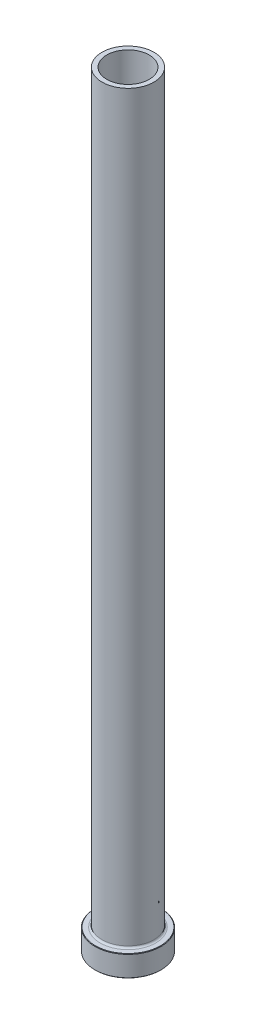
ISO-10303-21;
HEADER;
FILE_DESCRIPTION(('STEP AP214'),'2;1');
FILE_NAME('part.step','',(''),(''),'','','');
FILE_SCHEMA(('AUTOMOTIVE_DESIGN { 1 0 10303 214 1 1 1 1 }'));
ENDSEC;
DATA;
#1=APPLICATION_CONTEXT('core data for automotive mechanical design processes');
#2=APPLICATION_PROTOCOL_DEFINITION('international standard','automotive_design',2000,#1);
#3=PRODUCT_CONTEXT('',#1,'mechanical');
#4=PRODUCT('Part','Part','',(#3));
#5=PRODUCT_RELATED_PRODUCT_CATEGORY('part','',(#4));
#6=PRODUCT_DEFINITION_FORMATION('','',#4);
#7=PRODUCT_DEFINITION_CONTEXT('part definition',#1,'design');
#8=PRODUCT_DEFINITION('design','',#6,#7);
#9=PRODUCT_DEFINITION_SHAPE('','',#8);
#10=(LENGTH_UNIT() NAMED_UNIT(*) SI_UNIT(.MILLI.,.METRE.));
#11=(NAMED_UNIT(*) PLANE_ANGLE_UNIT() SI_UNIT($,.RADIAN.));
#12=(NAMED_UNIT(*) SI_UNIT($,.STERADIAN.) SOLID_ANGLE_UNIT());
#13=UNCERTAINTY_MEASURE_WITH_UNIT(LENGTH_MEASURE(1.E-05),#10,'distance_accuracy_value','');
#14=(GEOMETRIC_REPRESENTATION_CONTEXT(3) GLOBAL_UNCERTAINTY_ASSIGNED_CONTEXT((#13)) GLOBAL_UNIT_ASSIGNED_CONTEXT((#10,
#11,#12)) REPRESENTATION_CONTEXT('',''));
#15=CARTESIAN_POINT('',(0.,0.,0.));
#16=DIRECTION('',(0.,0.,1.));
#17=DIRECTION('',(1.,0.,0.));
#18=AXIS2_PLACEMENT_3D('',#15,#16,#17);
#19=CARTESIAN_POINT('',(0.,92.1876809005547,0.));
#20=DIRECTION('',(0.,1.,0.));
#21=DIRECTION('',(0.,0.,1.));
#22=AXIS2_PLACEMENT_3D('',#19,#20,#21);
#23=CYLINDRICAL_SURFACE('',#22,9.00000000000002);
#24=CARTESIAN_POINT('',(0.,325.,0.));
#25=DIRECTION('',(0.,1.,0.));
#26=DIRECTION('',(0.,0.,1.));
#27=AXIS2_PLACEMENT_3D('',#24,#25,#26);
#28=CIRCLE('',#27,9.00000000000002);
#29=CARTESIAN_POINT('',(0.,325.,9.00000000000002));
#30=VERTEX_POINT('',#29);
#31=EDGE_CURVE('E62',#30,#30,#28,.T.);
#32=ORIENTED_EDGE('',*,*,#31,.T.);
#33=EDGE_LOOP('',(#32));
#34=FACE_BOUND('',#33,.T.);
#35=CARTESIAN_POINT('',(0.,270.,0.));
#36=DIRECTION('',(0.,1.,0.));
#37=DIRECTION('',(0.,0.,1.));
#38=AXIS2_PLACEMENT_3D('',#35,#36,#37);
#39=CIRCLE('',#38,9.00000000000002);
#40=CARTESIAN_POINT('',(0.,270.,9.00000000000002));
#41=VERTEX_POINT('',#40);
#42=EDGE_CURVE('E71',#41,#41,#39,.T.);
#43=ORIENTED_EDGE('',*,*,#42,.F.);
#44=EDGE_LOOP('',(#43));
#45=FACE_BOUND('',#44,.T.);
#46=ADVANCED_FACE('F30',(#34,#45),#23,.F.);
#47=CARTESIAN_POINT('',(-9.00000000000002,325.,0.));
#48=DIRECTION('',(0.,1.,0.));
#49=DIRECTION('',(0.,0.,1.));
#50=AXIS2_PLACEMENT_3D('',#47,#48,#49);
#51=PLANE('',#50);
#52=CARTESIAN_POINT('',(0.,325.,0.));
#53=DIRECTION('',(0.,1.,0.));
#54=DIRECTION('',(0.,0.,1.));
#55=AXIS2_PLACEMENT_3D('',#52,#53,#54);
#56=CIRCLE('',#55,11.);
#57=CARTESIAN_POINT('',(0.,325.,11.));
#58=VERTEX_POINT('',#57);
#59=EDGE_CURVE('E65',#58,#58,#56,.T.);
#60=ORIENTED_EDGE('',*,*,#59,.T.);
#61=EDGE_LOOP('',(#60));
#62=FACE_BOUND('',#61,.T.);
#63=ORIENTED_EDGE('',*,*,#31,.F.);
#64=EDGE_LOOP('',(#63));
#65=FACE_BOUND('',#64,.T.);
#66=ADVANCED_FACE('F79',(#62,#65),#51,.T.);
#67=CARTESIAN_POINT('',(0.,92.1876809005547,0.));
#68=DIRECTION('',(0.,1.,0.));
#69=DIRECTION('',(0.,0.,1.));
#70=AXIS2_PLACEMENT_3D('',#67,#68,#69);
#71=CYLINDRICAL_SURFACE('',#70,11.);
#72=CARTESIAN_POINT('',(0.,9.8,0.));
#73=DIRECTION('',(0.,1.,0.));
#74=DIRECTION('',(0.,0.,1.));
#75=AXIS2_PLACEMENT_3D('',#72,#73,#74);
#76=CIRCLE('',#75,11.);
#77=CARTESIAN_POINT('',(0.,9.8,11.));
#78=VERTEX_POINT('',#77);
#79=EDGE_CURVE('E59',#78,#78,#76,.T.);
#80=ORIENTED_EDGE('',*,*,#79,.T.);
#81=EDGE_LOOP('',(#80));
#82=FACE_BOUND('',#81,.T.);
#83=ORIENTED_EDGE('',*,*,#59,.F.);
#84=EDGE_LOOP('',(#83));
#85=FACE_BOUND('',#84,.T.);
#86=ADVANCED_FACE('F85',(#82,#85),#71,.T.);
#87=CARTESIAN_POINT('',(-11.,9.,0.));
#88=DIRECTION('',(0.,1.,0.));
#89=DIRECTION('',(0.,0.,1.));
#90=AXIS2_PLACEMENT_3D('',#87,#88,#89);
#91=PLANE('',#90);
#92=CARTESIAN_POINT('',(0.,9.,0.));
#93=DIRECTION('',(0.,1.,0.));
#94=DIRECTION('',(0.,0.,1.));
#95=AXIS2_PLACEMENT_3D('',#92,#93,#94);
#96=CIRCLE('',#95,13.8);
#97=CARTESIAN_POINT('',(0.,9.,13.8));
#98=VERTEX_POINT('',#97);
#99=EDGE_CURVE('E53',#98,#98,#96,.T.);
#100=ORIENTED_EDGE('',*,*,#99,.T.);
#101=EDGE_LOOP('',(#100));
#102=FACE_BOUND('',#101,.T.);
#103=CARTESIAN_POINT('',(0.,9.,0.));
#104=DIRECTION('',(0.,1.,0.));
#105=DIRECTION('',(0.,0.,1.));
#106=AXIS2_PLACEMENT_3D('',#103,#104,#105);
#107=CIRCLE('',#106,11.8);
#108=CARTESIAN_POINT('',(0.,9.,11.8));
#109=VERTEX_POINT('',#108);
#110=EDGE_CURVE('E56',#109,#109,#107,.F.);
#111=ORIENTED_EDGE('',*,*,#110,.T.);
#112=EDGE_LOOP('',(#111));
#113=FACE_BOUND('',#112,.T.);
#114=ADVANCED_FACE('F111',(#102,#113),#91,.T.);
#115=CARTESIAN_POINT('',(0.,92.1876809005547,0.));
#116=DIRECTION('',(0.,1.,0.));
#117=DIRECTION('',(0.,0.,1.));
#118=AXIS2_PLACEMENT_3D('',#115,#116,#117);
#119=CYLINDRICAL_SURFACE('',#118,14.);
#120=CARTESIAN_POINT('',(0.,8.8,0.));
#121=DIRECTION('',(0.,1.,0.));
#122=DIRECTION('',(0.,0.,1.));
#123=AXIS2_PLACEMENT_3D('',#120,#121,#122);
#124=CIRCLE('',#123,14.);
#125=CARTESIAN_POINT('',(0.,8.8,14.));
#126=VERTEX_POINT('',#125);
#127=EDGE_CURVE('E45',#126,#126,#124,.F.);
#128=ORIENTED_EDGE('',*,*,#127,.T.);
#129=EDGE_LOOP('',(#128));
#130=FACE_BOUND('',#129,.T.);
#131=CARTESIAN_POINT('',(0.,0.20000000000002,0.));
#132=DIRECTION('',(0.,-1.,0.));
#133=DIRECTION('',(0.,0.,-1.));
#134=AXIS2_PLACEMENT_3D('',#131,#132,#133);
#135=CIRCLE('',#134,14.);
#136=CARTESIAN_POINT('',(0.,0.20000000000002,-14.));
#137=VERTEX_POINT('',#136);
#138=EDGE_CURVE('E50',#137,#137,#135,.F.);
#139=ORIENTED_EDGE('',*,*,#138,.T.);
#140=EDGE_LOOP('',(#139));
#141=FACE_BOUND('',#140,.T.);
#142=ADVANCED_FACE('F108',(#130,#141),#119,.T.);
#143=CARTESIAN_POINT('',(-14.,0.,0.));
#144=DIRECTION('',(0.,-1.,0.));
#145=DIRECTION('',(0.,0.,-1.));
#146=AXIS2_PLACEMENT_3D('',#143,#144,#145);
#147=PLANE('',#146);
#148=CARTESIAN_POINT('',(0.,0.,0.));
#149=DIRECTION('',(0.,-1.,0.));
#150=DIRECTION('',(0.,0.,-1.));
#151=AXIS2_PLACEMENT_3D('',#148,#149,#150);
#152=CIRCLE('',#151,9.75000000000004);
#153=CARTESIAN_POINT('',(0.,0.,-9.75000000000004));
#154=VERTEX_POINT('',#153);
#155=EDGE_CURVE('E37',#154,#154,#152,.F.);
#156=ORIENTED_EDGE('',*,*,#155,.T.);
#157=EDGE_LOOP('',(#156));
#158=FACE_BOUND('',#157,.T.);
#159=CARTESIAN_POINT('',(0.,0.,0.));
#160=DIRECTION('',(0.,-1.,0.));
#161=DIRECTION('',(0.,0.,-1.));
#162=AXIS2_PLACEMENT_3D('',#159,#160,#161);
#163=CIRCLE('',#162,13.7999999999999);
#164=CARTESIAN_POINT('',(0.,0.,-13.7999999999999));
#165=VERTEX_POINT('',#164);
#166=EDGE_CURVE('E41',#165,#165,#163,.T.);
#167=ORIENTED_EDGE('',*,*,#166,.T.);
#168=EDGE_LOOP('',(#167));
#169=FACE_BOUND('',#168,.T.);
#170=ADVANCED_FACE('F110',(#158,#169),#147,.T.);
#171=CARTESIAN_POINT('',(0.,92.1876809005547,0.));
#172=DIRECTION('',(0.,1.,0.));
#173=DIRECTION('',(0.,0.,1.));
#174=AXIS2_PLACEMENT_3D('',#171,#172,#173);
#175=CYLINDRICAL_SURFACE('',#174,9.25000000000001);
#176=CARTESIAN_POINT('',(0.,0.500000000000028,0.));
#177=DIRECTION('',(0.,-1.,0.));
#178=DIRECTION('',(0.,0.,-1.));
#179=AXIS2_PLACEMENT_3D('',#176,#177,#178);
#180=CIRCLE('',#179,9.25000000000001);
#181=CARTESIAN_POINT('',(0.,0.500000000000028,-9.25000000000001));
#182=VERTEX_POINT('',#181);
#183=EDGE_CURVE('E10',#182,#182,#180,.T.);
#184=ORIENTED_EDGE('',*,*,#183,.T.);
#185=EDGE_LOOP('',(#184));
#186=FACE_BOUND('',#185,.T.);
#187=CARTESIAN_POINT('',(0.,258.,0.));
#188=DIRECTION('',(0.,1.,0.));
#189=DIRECTION('',(0.,0.,1.));
#190=AXIS2_PLACEMENT_3D('',#187,#188,#189);
#191=CIRCLE('',#190,9.25000000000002);
#192=CARTESIAN_POINT('',(0.,258.,9.25000000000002));
#193=VERTEX_POINT('',#192);
#194=EDGE_CURVE('E68',#193,#193,#191,.T.);
#195=ORIENTED_EDGE('',*,*,#194,.T.);
#196=EDGE_LOOP('',(#195));
#197=FACE_BOUND('',#196,.T.);
#198=ADVANCED_FACE('F118',(#186,#197),#175,.F.);
#199=CARTESIAN_POINT('',(0.,258.,0.));
#200=DIRECTION('',(0.,-1.,0.));
#201=DIRECTION('',(0.,0.,-1.));
#202=AXIS2_PLACEMENT_3D('',#199,#200,#201);
#203=CONICAL_SURFACE('',#202,9.25000000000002,0.0208303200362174);
#204=ORIENTED_EDGE('',*,*,#42,.T.);
#205=EDGE_LOOP('',(#204));
#206=FACE_BOUND('',#205,.T.);
#207=ORIENTED_EDGE('',*,*,#194,.F.);
#208=EDGE_LOOP('',(#207));
#209=FACE_BOUND('',#208,.T.);
#210=ADVANCED_FACE('F75',(#206,#209),#203,.F.);
#211=CARTESIAN_POINT('',(0.,9.8,0.));
#212=DIRECTION('',(0.,1.,0.));
#213=DIRECTION('',(0.,0.,1.));
#214=AXIS2_PLACEMENT_3D('',#211,#212,#213);
#215=TOROIDAL_SURFACE('',#214,11.8,0.8);
#216=ORIENTED_EDGE('',*,*,#110,.F.);
#217=EDGE_LOOP('',(#216));
#218=FACE_BOUND('',#217,.T.);
#219=ORIENTED_EDGE('',*,*,#79,.F.);
#220=EDGE_LOOP('',(#219));
#221=FACE_BOUND('',#220,.T.);
#222=ADVANCED_FACE('F90',(#218,#221),#215,.F.);
#223=CARTESIAN_POINT('',(0.,8.99999999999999,0.));
#224=DIRECTION('',(0.,-1.,0.));
#225=DIRECTION('',(0.,0.,-1.));
#226=AXIS2_PLACEMENT_3D('',#223,#224,#225);
#227=CONICAL_SURFACE('',#226,13.8,0.785398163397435);
#228=ORIENTED_EDGE('',*,*,#127,.F.);
#229=EDGE_LOOP('',(#228));
#230=FACE_BOUND('',#229,.T.);
#231=ORIENTED_EDGE('',*,*,#99,.F.);
#232=EDGE_LOOP('',(#231));
#233=FACE_BOUND('',#232,.T.);
#234=ADVANCED_FACE('F93',(#230,#233),#227,.T.);
#235=CARTESIAN_POINT('',(0.,0.20000000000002,0.));
#236=DIRECTION('',(0.,1.,0.));
#237=DIRECTION('',(0.,0.,1.));
#238=AXIS2_PLACEMENT_3D('',#235,#236,#237);
#239=CONICAL_SURFACE('',#238,14.,0.785398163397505);
#240=ORIENTED_EDGE('',*,*,#166,.F.);
#241=EDGE_LOOP('',(#240));
#242=FACE_BOUND('',#241,.T.);
#243=ORIENTED_EDGE('',*,*,#138,.F.);
#244=EDGE_LOOP('',(#243));
#245=FACE_BOUND('',#244,.T.);
#246=ADVANCED_FACE('F96',(#242,#245),#239,.T.);
#247=CARTESIAN_POINT('',(0.,0.,0.));
#248=DIRECTION('',(0.,-1.,0.));
#249=DIRECTION('',(0.,0.,-1.));
#250=AXIS2_PLACEMENT_3D('',#247,#248,#249);
#251=CONICAL_SURFACE('',#250,9.75000000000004,0.785398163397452);
#252=ORIENTED_EDGE('',*,*,#183,.F.);
#253=EDGE_LOOP('',(#252));
#254=FACE_BOUND('',#253,.T.);
#255=ORIENTED_EDGE('',*,*,#155,.F.);
#256=EDGE_LOOP('',(#255));
#257=FACE_BOUND('',#256,.T.);
#258=ADVANCED_FACE('F32',(#254,#257),#251,.F.);
#259=CLOSED_SHELL('',(#46,#66,#86,#114,#142,#170,#198,#210,#222,#234,#246,#258));
#260=MANIFOLD_SOLID_BREP('B2',#259);
#261=ADVANCED_BREP_SHAPE_REPRESENTATION('',(#18,#260),#14);
#262=SHAPE_DEFINITION_REPRESENTATION(#9,#261);
ENDSEC;
END-ISO-10303-21;
